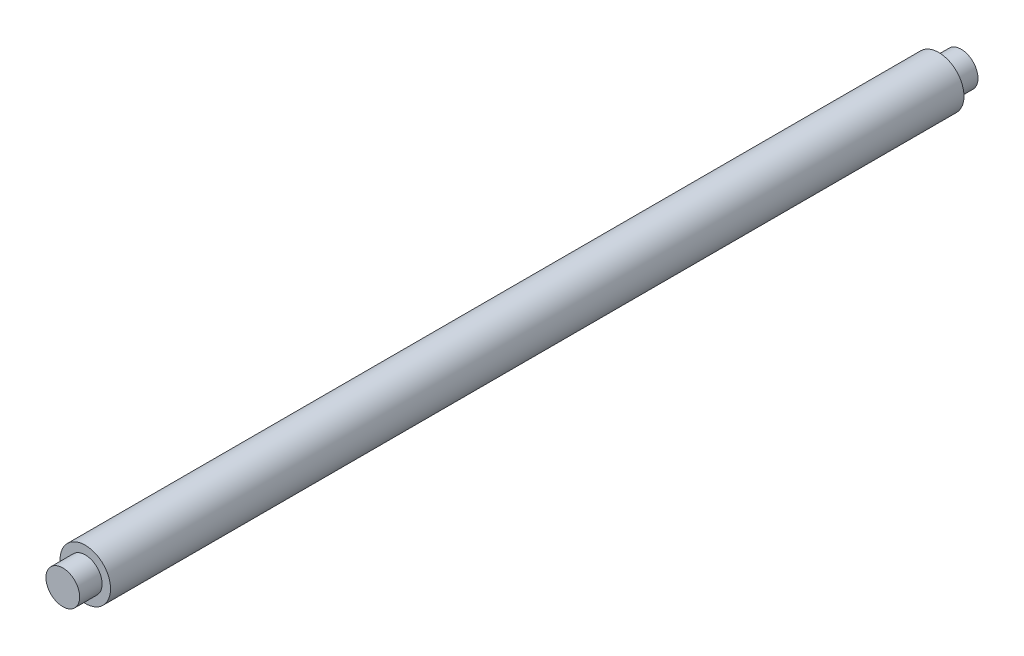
from build123d import *

# Parameters (mm, degrees)
ESQUISSE1_R      = 2.25
EXTRUSION1_DEPTH = 38
ESQUISSE2_R      = 1.5
EXTRUSION2_DEPTH = 2


with BuildPart() as part:
    # Esquisse1 → Extrusion1 (new body)
    with BuildSketch(Plane.XY):
        Circle(ESQUISSE1_R)
    extrude(amount=EXTRUSION1_DEPTH)

    # Esquisse2 → Extrusion2 (add)
    with BuildSketch(Plane.XY.offset(38)):
        Circle(ESQUISSE2_R)
    extrude(amount=EXTRUSION2_DEPTH)

    # Sym_trie1: part across plane


with BuildPart() as part_1:
    add(part.part)
    add(part.part.mirror(Plane.XY))


solid = part_1.part
